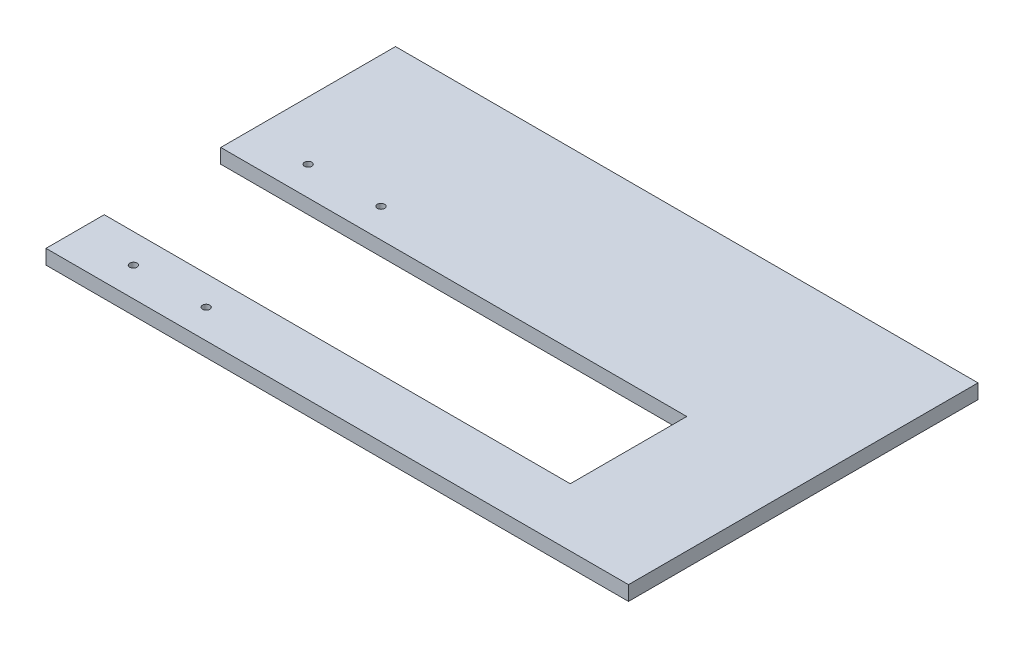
from build123d import *

# Parameters (mm, degrees)
SKETCH1_W           = 254
SKETCH1_H           = 152.4
BOSS_EXTRUDE1_DEPTH = 6.35
SKETCH3_W           = 203.2
SKETCH3_H           = 50.8
CUT_EXTRUDE1_DEPTH  = 6.35
SKETCH4_R           = 1.5875
CUT_EXTRUDE2_DEPTH  = 25.4


with BuildPart() as part:
    # Sketch1 → Boss-Extrude1 (new body)
    with BuildSketch(Plane(origin=(0, 0, 0), x_dir=(1, 0, 0), z_dir=(0, 1, 0))):
        with Locations((127, 76.2)):
            Rectangle(SKETCH1_W, SKETCH1_H)
    extrude(amount=BOSS_EXTRUDE1_DEPTH)

    # Sketch3 → Cut-Extrude1 (cut)
    with BuildSketch(Plane(origin=(0, 6.35, 0), x_dir=(1, 0, 0), z_dir=(0, 1, 0))):
        with Locations((101.6, 50.8)):
            Rectangle(SKETCH3_W, SKETCH3_H)
    extrude(amount=-CUT_EXTRUDE1_DEPTH, mode=Mode.SUBTRACT)

    # Sketch4 → Cut-Extrude2 (cut)
    with BuildSketch(Plane(origin=(0, 6.35, 0), x_dir=(1, 0, 0), z_dir=(0, 1, 0))):
        with Locations(Location((25.4, 88.9, 0), (0, 0, 270))):
            Circle(SKETCH4_R)
        with Locations(Location((57.15, 88.9, 0), (0, 0, 270))):
            Circle(SKETCH4_R)
        with Locations(Location((25.4, 12.7, 0), (0, 0, 270))):
            Circle(SKETCH4_R)
        with Locations(Location((57.15, 12.7, 0), (0, 0, 270))):
            Circle(SKETCH4_R)
    extrude(amount=-CUT_EXTRUDE2_DEPTH, mode=Mode.SUBTRACT)


solid = part.part
